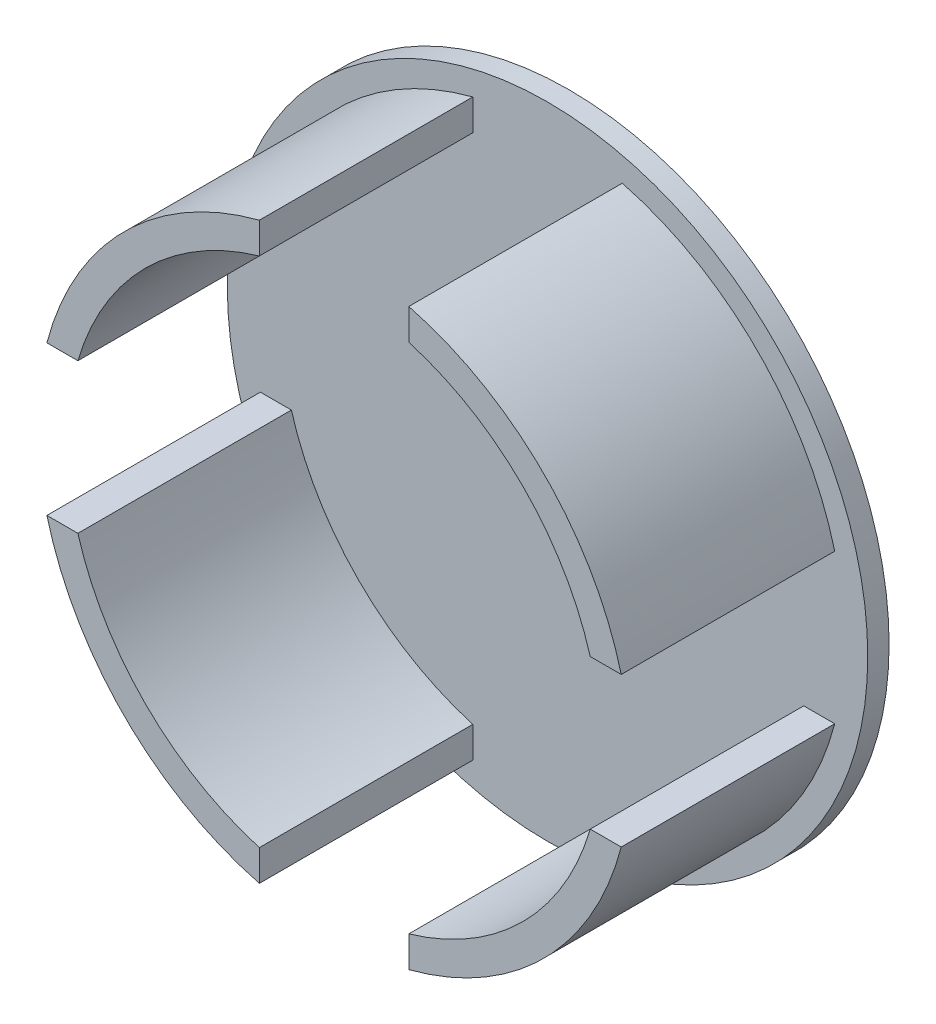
ISO-10303-21;
HEADER;
FILE_DESCRIPTION(('STEP AP214'),'2;1');
FILE_NAME('part.step','',(''),(''),'','','');
FILE_SCHEMA(('AUTOMOTIVE_DESIGN { 1 0 10303 214 1 1 1 1 }'));
ENDSEC;
DATA;
#1=APPLICATION_CONTEXT('core data for automotive mechanical design processes');
#2=APPLICATION_PROTOCOL_DEFINITION('international standard','automotive_design',2000,#1);
#3=PRODUCT_CONTEXT('',#1,'mechanical');
#4=PRODUCT('Part','Part','',(#3));
#5=PRODUCT_RELATED_PRODUCT_CATEGORY('part','',(#4));
#6=PRODUCT_DEFINITION_FORMATION('','',#4);
#7=PRODUCT_DEFINITION_CONTEXT('part definition',#1,'design');
#8=PRODUCT_DEFINITION('design','',#6,#7);
#9=PRODUCT_DEFINITION_SHAPE('','',#8);
#10=(LENGTH_UNIT() NAMED_UNIT(*) SI_UNIT(.MILLI.,.METRE.));
#11=(NAMED_UNIT(*) PLANE_ANGLE_UNIT() SI_UNIT($,.RADIAN.));
#12=(NAMED_UNIT(*) SI_UNIT($,.STERADIAN.) SOLID_ANGLE_UNIT());
#13=UNCERTAINTY_MEASURE_WITH_UNIT(LENGTH_MEASURE(1.E-05),#10,'distance_accuracy_value','');
#14=(GEOMETRIC_REPRESENTATION_CONTEXT(3) GLOBAL_UNCERTAINTY_ASSIGNED_CONTEXT((#13)) GLOBAL_UNIT_ASSIGNED_CONTEXT((#10,
#11,#12)) REPRESENTATION_CONTEXT('',''));
#15=CARTESIAN_POINT('',(0.,0.,0.));
#16=DIRECTION('',(0.,0.,1.));
#17=DIRECTION('',(1.,0.,0.));
#18=AXIS2_PLACEMENT_3D('',#15,#16,#17);
#19=CARTESIAN_POINT('',(0.,0.,11.));
#20=DIRECTION('',(0.,0.,1.));
#21=DIRECTION('',(1.,0.,0.));
#22=AXIS2_PLACEMENT_3D('',#19,#20,#21);
#23=PLANE('',#22);
#24=DIRECTION('',(0.,1.,0.));
#25=VECTOR('',#24,1.);
#26=CARTESIAN_POINT('',(3.5,-3.5,11.));
#27=LINE('',#26,#25);
#28=CARTESIAN_POINT('',(3.5,-13.4521373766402,11.));
#29=VERTEX_POINT('',#28);
#30=CARTESIAN_POINT('',(3.5,-12.,11.));
#31=VERTEX_POINT('',#30);
#32=EDGE_CURVE('E175',#29,#31,#27,.T.);
#33=ORIENTED_EDGE('',*,*,#32,.F.);
#34=CARTESIAN_POINT('',(0.,0.,11.));
#35=DIRECTION('',(0.,0.,1.));
#36=DIRECTION('',(1.,0.,0.));
#37=AXIS2_PLACEMENT_3D('',#34,#35,#36);
#38=CIRCLE('',#37,13.9);
#39=CARTESIAN_POINT('',(13.4521373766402,-3.5,11.));
#40=VERTEX_POINT('',#39);
#41=EDGE_CURVE('E173',#29,#40,#38,.T.);
#42=ORIENTED_EDGE('',*,*,#41,.T.);
#43=DIRECTION('',(1.,0.,0.));
#44=VECTOR('',#43,1.);
#45=CARTESIAN_POINT('',(3.5,-3.5,11.));
#46=LINE('',#45,#44);
#47=CARTESIAN_POINT('',(12.,-3.5,11.));
#48=VERTEX_POINT('',#47);
#49=EDGE_CURVE('E157',#48,#40,#46,.T.);
#50=ORIENTED_EDGE('',*,*,#49,.F.);
#51=CARTESIAN_POINT('',(0.,0.,11.));
#52=DIRECTION('',(0.,0.,1.));
#53=DIRECTION('',(1.,0.,0.));
#54=AXIS2_PLACEMENT_3D('',#51,#52,#53);
#55=CIRCLE('',#54,12.5);
#56=EDGE_CURVE('E171',#31,#48,#55,.T.);
#57=ORIENTED_EDGE('',*,*,#56,.F.);
#58=EDGE_LOOP('',(#33,#42,#50,#57));
#59=FACE_BOUND('',#58,.T.);
#60=ADVANCED_FACE('F39',(#59),#23,.T.);
#61=DIRECTION('',(0.,-1.,0.));
#62=VECTOR('',#61,1.);
#63=CARTESIAN_POINT('',(-3.5,-3.5,11.));
#64=LINE('',#63,#62);
#65=CARTESIAN_POINT('',(-3.5,-12.,11.));
#66=VERTEX_POINT('',#65);
#67=CARTESIAN_POINT('',(-3.5,-13.4521373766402,11.));
#68=VERTEX_POINT('',#67);
#69=EDGE_CURVE('E222',#66,#68,#64,.T.);
#70=ORIENTED_EDGE('',*,*,#69,.F.);
#71=CARTESIAN_POINT('',(-12.,-3.5,11.));
#72=VERTEX_POINT('',#71);
#73=EDGE_CURVE('E181',#72,#66,#55,.T.);
#74=ORIENTED_EDGE('',*,*,#73,.F.);
#75=DIRECTION('',(1.,0.,0.));
#76=VECTOR('',#75,1.);
#77=CARTESIAN_POINT('',(-20.7115293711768,-3.5,11.));
#78=LINE('',#77,#76);
#79=CARTESIAN_POINT('',(-13.4521373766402,-3.5,11.));
#80=VERTEX_POINT('',#79);
#81=EDGE_CURVE('E220',#80,#72,#78,.T.);
#82=ORIENTED_EDGE('',*,*,#81,.F.);
#83=EDGE_CURVE('E296',#80,#68,#38,.T.);
#84=ORIENTED_EDGE('',*,*,#83,.T.);
#85=EDGE_LOOP('',(#70,#74,#82,#84));
#86=FACE_BOUND('',#85,.T.);
#87=ADVANCED_FACE('F321',(#86),#23,.T.);
#88=DIRECTION('',(-1.,0.,0.));
#89=VECTOR('',#88,1.);
#90=CARTESIAN_POINT('',(-20.7115293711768,3.5,11.));
#91=LINE('',#90,#89);
#92=CARTESIAN_POINT('',(-12.,3.5,11.));
#93=VERTEX_POINT('',#92);
#94=CARTESIAN_POINT('',(-13.4521373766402,3.5,11.));
#95=VERTEX_POINT('',#94);
#96=EDGE_CURVE('E216',#93,#95,#91,.T.);
#97=ORIENTED_EDGE('',*,*,#96,.F.);
#98=CARTESIAN_POINT('',(-3.5,12.,11.));
#99=VERTEX_POINT('',#98);
#100=EDGE_CURVE('E186',#99,#93,#55,.T.);
#101=ORIENTED_EDGE('',*,*,#100,.F.);
#102=DIRECTION('',(0.,-1.,0.));
#103=VECTOR('',#102,1.);
#104=CARTESIAN_POINT('',(-3.5,18.3029045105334,11.));
#105=LINE('',#104,#103);
#106=CARTESIAN_POINT('',(-3.5,13.4521373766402,11.));
#107=VERTEX_POINT('',#106);
#108=EDGE_CURVE('E214',#107,#99,#105,.T.);
#109=ORIENTED_EDGE('',*,*,#108,.F.);
#110=EDGE_CURVE('E217',#107,#95,#38,.T.);
#111=ORIENTED_EDGE('',*,*,#110,.T.);
#112=EDGE_LOOP('',(#97,#101,#109,#111));
#113=FACE_BOUND('',#112,.T.);
#114=ADVANCED_FACE('F212',(#113),#23,.T.);
#115=CARTESIAN_POINT('',(0.,0.,11.));
#116=DIRECTION('',(0.,0.,-1.));
#117=DIRECTION('',(-1.,0.,0.));
#118=AXIS2_PLACEMENT_3D('',#115,#116,#117);
#119=CYLINDRICAL_SURFACE('',#118,13.9);
#120=ORIENTED_EDGE('',*,*,#41,.F.);
#121=DIRECTION('',(0.,0.,-1.));
#122=VECTOR('',#121,1.);
#123=CARTESIAN_POINT('',(3.5,-13.4521373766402,11.));
#124=LINE('',#123,#122);
#125=CARTESIAN_POINT('',(3.5,-13.4521373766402,0.999999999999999));
#126=VERTEX_POINT('',#125);
#127=EDGE_CURVE('E182',#29,#126,#124,.T.);
#128=ORIENTED_EDGE('',*,*,#127,.T.);
#129=CARTESIAN_POINT('',(0.,0.,1.));
#130=DIRECTION('',(0.,0.,1.));
#131=DIRECTION('',(1.,0.,0.));
#132=AXIS2_PLACEMENT_3D('',#129,#130,#131);
#133=CIRCLE('',#132,13.9);
#134=CARTESIAN_POINT('',(13.4521373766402,-3.5,0.999999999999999));
#135=VERTEX_POINT('',#134);
#136=EDGE_CURVE('E191',#126,#135,#133,.T.);
#137=ORIENTED_EDGE('',*,*,#136,.T.);
#138=DIRECTION('',(0.,0.,-1.));
#139=VECTOR('',#138,1.);
#140=CARTESIAN_POINT('',(13.4521373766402,-3.5,11.));
#141=LINE('',#140,#139);
#142=EDGE_CURVE('E164',#135,#40,#141,.F.);
#143=ORIENTED_EDGE('',*,*,#142,.T.);
#144=EDGE_LOOP('',(#120,#128,#137,#143));
#145=FACE_BOUND('',#144,.T.);
#146=ADVANCED_FACE('F352',(#145),#119,.T.);
#147=CARTESIAN_POINT('',(-13.4521373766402,-3.5,0.999999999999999));
#148=VERTEX_POINT('',#147);
#149=CARTESIAN_POINT('',(-3.5,-13.4521373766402,0.999999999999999));
#150=VERTEX_POINT('',#149);
#151=EDGE_CURVE('E197',#148,#150,#133,.T.);
#152=ORIENTED_EDGE('',*,*,#151,.T.);
#153=DIRECTION('',(0.,0.,-1.));
#154=VECTOR('',#153,1.);
#155=CARTESIAN_POINT('',(-3.5,-13.4521373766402,11.));
#156=LINE('',#155,#154);
#157=EDGE_CURVE('E256',#150,#68,#156,.F.);
#158=ORIENTED_EDGE('',*,*,#157,.T.);
#159=ORIENTED_EDGE('',*,*,#83,.F.);
#160=DIRECTION('',(0.,0.,-1.));
#161=VECTOR('',#160,1.);
#162=CARTESIAN_POINT('',(-13.4521373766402,-3.5,11.));
#163=LINE('',#162,#161);
#164=EDGE_CURVE('E251',#80,#148,#163,.T.);
#165=ORIENTED_EDGE('',*,*,#164,.T.);
#166=EDGE_LOOP('',(#152,#158,#159,#165));
#167=FACE_BOUND('',#166,.T.);
#168=ADVANCED_FACE('F323',(#167),#119,.T.);
#169=CARTESIAN_POINT('',(-3.5,13.4521373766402,0.999999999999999));
#170=VERTEX_POINT('',#169);
#171=CARTESIAN_POINT('',(-13.4521373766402,3.5,0.999999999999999));
#172=VERTEX_POINT('',#171);
#173=EDGE_CURVE('E298',#170,#172,#133,.T.);
#174=ORIENTED_EDGE('',*,*,#173,.T.);
#175=DIRECTION('',(0.,0.,-1.));
#176=VECTOR('',#175,1.);
#177=CARTESIAN_POINT('',(-13.4521373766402,3.5,11.));
#178=LINE('',#177,#176);
#179=EDGE_CURVE('E246',#172,#95,#178,.F.);
#180=ORIENTED_EDGE('',*,*,#179,.T.);
#181=ORIENTED_EDGE('',*,*,#110,.F.);
#182=DIRECTION('',(0.,0.,-1.));
#183=VECTOR('',#182,1.);
#184=CARTESIAN_POINT('',(-3.5,13.4521373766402,11.));
#185=LINE('',#184,#183);
#186=EDGE_CURVE('E242',#107,#170,#185,.T.);
#187=ORIENTED_EDGE('',*,*,#186,.T.);
#188=EDGE_LOOP('',(#174,#180,#181,#187));
#189=FACE_BOUND('',#188,.T.);
#190=ADVANCED_FACE('F353',(#189),#119,.T.);
#191=CARTESIAN_POINT('',(0.,0.,11.));
#192=DIRECTION('',(0.,0.,-1.));
#193=DIRECTION('',(-1.,0.,0.));
#194=AXIS2_PLACEMENT_3D('',#191,#192,#193);
#195=CYLINDRICAL_SURFACE('',#194,12.5);
#196=DIRECTION('',(0.,0.,-1.));
#197=VECTOR('',#196,1.);
#198=CARTESIAN_POINT('',(3.5,-12.,11.));
#199=LINE('',#198,#197);
#200=CARTESIAN_POINT('',(3.5,-12.,1.));
#201=VERTEX_POINT('',#200);
#202=EDGE_CURVE('E180',#31,#201,#199,.T.);
#203=ORIENTED_EDGE('',*,*,#202,.F.);
#204=ORIENTED_EDGE('',*,*,#56,.T.);
#205=DIRECTION('',(0.,0.,-1.));
#206=VECTOR('',#205,1.);
#207=CARTESIAN_POINT('',(12.,-3.5,11.));
#208=LINE('',#207,#206);
#209=CARTESIAN_POINT('',(12.,-3.5,0.999999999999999));
#210=VERTEX_POINT('',#209);
#211=EDGE_CURVE('E154',#210,#48,#208,.F.);
#212=ORIENTED_EDGE('',*,*,#211,.F.);
#213=CARTESIAN_POINT('',(0.,0.,1.));
#214=DIRECTION('',(0.,0.,1.));
#215=DIRECTION('',(1.,0.,0.));
#216=AXIS2_PLACEMENT_3D('',#213,#214,#215);
#217=CIRCLE('',#216,12.5);
#218=EDGE_CURVE('E11',#210,#201,#217,.F.);
#219=ORIENTED_EDGE('',*,*,#218,.T.);
#220=EDGE_LOOP('',(#203,#204,#212,#219));
#221=FACE_BOUND('',#220,.T.);
#222=ADVANCED_FACE('F178',(#221),#195,.F.);
#223=DIRECTION('',(0.,0.,-1.));
#224=VECTOR('',#223,1.);
#225=CARTESIAN_POINT('',(-3.5,-12.,11.));
#226=LINE('',#225,#224);
#227=CARTESIAN_POINT('',(-3.5,-12.,0.999999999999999));
#228=VERTEX_POINT('',#227);
#229=EDGE_CURVE('E254',#228,#66,#226,.F.);
#230=ORIENTED_EDGE('',*,*,#229,.F.);
#231=CARTESIAN_POINT('',(-12.,-3.5,1.));
#232=VERTEX_POINT('',#231);
#233=EDGE_CURVE('E47',#228,#232,#217,.F.);
#234=ORIENTED_EDGE('',*,*,#233,.T.);
#235=DIRECTION('',(0.,0.,-1.));
#236=VECTOR('',#235,1.);
#237=CARTESIAN_POINT('',(-12.,-3.5,11.));
#238=LINE('',#237,#236);
#239=EDGE_CURVE('E248',#72,#232,#238,.T.);
#240=ORIENTED_EDGE('',*,*,#239,.F.);
#241=ORIENTED_EDGE('',*,*,#73,.T.);
#242=EDGE_LOOP('',(#230,#234,#240,#241));
#243=FACE_BOUND('',#242,.T.);
#244=ADVANCED_FACE('F310',(#243),#195,.F.);
#245=DIRECTION('',(0.,0.,-1.));
#246=VECTOR('',#245,1.);
#247=CARTESIAN_POINT('',(-12.,3.5,11.));
#248=LINE('',#247,#246);
#249=CARTESIAN_POINT('',(-12.,3.5,0.999999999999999));
#250=VERTEX_POINT('',#249);
#251=EDGE_CURVE('E207',#250,#93,#248,.F.);
#252=ORIENTED_EDGE('',*,*,#251,.F.);
#253=CARTESIAN_POINT('',(-3.5,12.,1.));
#254=VERTEX_POINT('',#253);
#255=EDGE_CURVE('E304',#250,#254,#217,.F.);
#256=ORIENTED_EDGE('',*,*,#255,.T.);
#257=DIRECTION('',(0.,0.,-1.));
#258=VECTOR('',#257,1.);
#259=CARTESIAN_POINT('',(-3.5,12.,11.));
#260=LINE('',#259,#258);
#261=EDGE_CURVE('E208',#99,#254,#260,.T.);
#262=ORIENTED_EDGE('',*,*,#261,.F.);
#263=ORIENTED_EDGE('',*,*,#100,.T.);
#264=EDGE_LOOP('',(#252,#256,#262,#263));
#265=FACE_BOUND('',#264,.T.);
#266=ADVANCED_FACE('F205',(#265),#195,.F.);
#267=CARTESIAN_POINT('',(0.,0.,1.));
#268=DIRECTION('',(0.,0.,-1.));
#269=DIRECTION('',(-1.,0.,0.));
#270=AXIS2_PLACEMENT_3D('',#267,#268,#269);
#271=CYLINDRICAL_SURFACE('',#270,15.);
#272=CARTESIAN_POINT('',(0.,0.,1.));
#273=DIRECTION('',(0.,0.,1.));
#274=DIRECTION('',(1.,0.,0.));
#275=AXIS2_PLACEMENT_3D('',#272,#273,#274);
#276=CIRCLE('',#275,15.);
#277=CARTESIAN_POINT('',(15.,0.,1.));
#278=VERTEX_POINT('',#277);
#279=EDGE_CURVE('E295',#278,#278,#276,.T.);
#280=ORIENTED_EDGE('',*,*,#279,.F.);
#281=EDGE_LOOP('',(#280));
#282=FACE_BOUND('',#281,.T.);
#283=CARTESIAN_POINT('',(0.,0.,0.));
#284=DIRECTION('',(0.,0.,1.));
#285=DIRECTION('',(1.,0.,0.));
#286=AXIS2_PLACEMENT_3D('',#283,#284,#285);
#287=CIRCLE('',#286,15.);
#288=CARTESIAN_POINT('',(15.,0.,0.));
#289=VERTEX_POINT('',#288);
#290=EDGE_CURVE('E293',#289,#289,#287,.T.);
#291=ORIENTED_EDGE('',*,*,#290,.T.);
#292=EDGE_LOOP('',(#291));
#293=FACE_BOUND('',#292,.T.);
#294=ADVANCED_FACE('F41',(#282,#293),#271,.T.);
#295=CARTESIAN_POINT('',(0.,0.,1.));
#296=DIRECTION('',(0.,0.,1.));
#297=DIRECTION('',(1.,0.,0.));
#298=AXIS2_PLACEMENT_3D('',#295,#296,#297);
#299=PLANE('',#298);
#300=ORIENTED_EDGE('',*,*,#136,.F.);
#301=DIRECTION('',(0.,1.,0.));
#302=VECTOR('',#301,1.);
#303=CARTESIAN_POINT('',(3.5,-3.5,0.999999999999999));
#304=LINE('',#303,#302);
#305=EDGE_CURVE('E228',#126,#201,#304,.T.);
#306=ORIENTED_EDGE('',*,*,#305,.T.);
#307=ORIENTED_EDGE('',*,*,#218,.F.);
#308=DIRECTION('',(1.,0.,0.));
#309=VECTOR('',#308,1.);
#310=CARTESIAN_POINT('',(3.5,-3.5,0.999999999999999));
#311=LINE('',#310,#309);
#312=EDGE_CURVE('E160',#210,#135,#311,.T.);
#313=ORIENTED_EDGE('',*,*,#312,.T.);
#314=EDGE_LOOP('',(#300,#306,#307,#313));
#315=FACE_BOUND('',#314,.T.);
#316=ORIENTED_EDGE('',*,*,#279,.T.);
#317=EDGE_LOOP('',(#316));
#318=FACE_BOUND('',#317,.T.);
#319=DIRECTION('',(0.,-1.,0.));
#320=VECTOR('',#319,1.);
#321=CARTESIAN_POINT('',(-3.5,-3.5,0.999999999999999));
#322=LINE('',#321,#320);
#323=EDGE_CURVE('E165',#228,#150,#322,.T.);
#324=ORIENTED_EDGE('',*,*,#323,.T.);
#325=ORIENTED_EDGE('',*,*,#151,.F.);
#326=DIRECTION('',(1.,0.,0.));
#327=VECTOR('',#326,1.);
#328=CARTESIAN_POINT('',(-20.7115293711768,-3.5,0.999999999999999));
#329=LINE('',#328,#327);
#330=EDGE_CURVE('E276',#148,#232,#329,.T.);
#331=ORIENTED_EDGE('',*,*,#330,.T.);
#332=ORIENTED_EDGE('',*,*,#233,.F.);
#333=EDGE_LOOP('',(#324,#325,#331,#332));
#334=FACE_BOUND('',#333,.T.);
#335=DIRECTION('',(-1.,0.,0.));
#336=VECTOR('',#335,1.);
#337=CARTESIAN_POINT('',(-20.7115293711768,3.5,0.999999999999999));
#338=LINE('',#337,#336);
#339=EDGE_CURVE('E273',#250,#172,#338,.T.);
#340=ORIENTED_EDGE('',*,*,#339,.T.);
#341=ORIENTED_EDGE('',*,*,#173,.F.);
#342=DIRECTION('',(0.,-1.,0.));
#343=VECTOR('',#342,1.);
#344=CARTESIAN_POINT('',(-3.5,18.3029045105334,0.999999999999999));
#345=LINE('',#344,#343);
#346=EDGE_CURVE('E63',#170,#254,#345,.T.);
#347=ORIENTED_EDGE('',*,*,#346,.T.);
#348=ORIENTED_EDGE('',*,*,#255,.F.);
#349=EDGE_LOOP('',(#340,#341,#347,#348));
#350=FACE_BOUND('',#349,.T.);
#351=DIRECTION('',(0.,1.,0.));
#352=VECTOR('',#351,1.);
#353=CARTESIAN_POINT('',(3.5,18.3029045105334,0.999999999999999));
#354=LINE('',#353,#352);
#355=CARTESIAN_POINT('',(3.5,12.,0.999999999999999));
#356=VERTEX_POINT('',#355);
#357=CARTESIAN_POINT('',(3.5,13.4521373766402,0.999999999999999));
#358=VERTEX_POINT('',#357);
#359=EDGE_CURVE('E269',#356,#358,#354,.T.);
#360=ORIENTED_EDGE('',*,*,#359,.T.);
#361=CARTESIAN_POINT('',(13.4521373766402,3.5,0.999999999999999));
#362=VERTEX_POINT('',#361);
#363=EDGE_CURVE('E199',#362,#358,#133,.T.);
#364=ORIENTED_EDGE('',*,*,#363,.F.);
#365=DIRECTION('',(-1.,0.,0.));
#366=VECTOR('',#365,1.);
#367=CARTESIAN_POINT('',(3.5,3.5,0.999999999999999));
#368=LINE('',#367,#366);
#369=CARTESIAN_POINT('',(12.,3.5,1.));
#370=VERTEX_POINT('',#369);
#371=EDGE_CURVE('E55',#362,#370,#368,.T.);
#372=ORIENTED_EDGE('',*,*,#371,.T.);
#373=EDGE_CURVE('E48',#356,#370,#217,.F.);
#374=ORIENTED_EDGE('',*,*,#373,.F.);
#375=EDGE_LOOP('',(#360,#364,#372,#374));
#376=FACE_BOUND('',#375,.T.);
#377=ADVANCED_FACE('F263',(#315,#318,#334,#350,#376),#299,.T.);
#378=CARTESIAN_POINT('',(0.,0.,0.));
#379=DIRECTION('',(0.,0.,1.));
#380=DIRECTION('',(1.,0.,0.));
#381=AXIS2_PLACEMENT_3D('',#378,#379,#380);
#382=PLANE('',#381);
#383=ORIENTED_EDGE('',*,*,#290,.F.);
#384=EDGE_LOOP('',(#383));
#385=FACE_BOUND('',#384,.T.);
#386=ADVANCED_FACE('F346',(#385),#382,.F.);
#387=DIRECTION('',(0.,1.,0.));
#388=VECTOR('',#387,1.);
#389=CARTESIAN_POINT('',(3.5,18.3029045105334,11.));
#390=LINE('',#389,#388);
#391=CARTESIAN_POINT('',(3.5,12.,11.));
#392=VERTEX_POINT('',#391);
#393=CARTESIAN_POINT('',(3.5,13.4521373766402,11.));
#394=VERTEX_POINT('',#393);
#395=EDGE_CURVE('E224',#392,#394,#390,.T.);
#396=ORIENTED_EDGE('',*,*,#395,.F.);
#397=CARTESIAN_POINT('',(12.,3.5,11.));
#398=VERTEX_POINT('',#397);
#399=EDGE_CURVE('E184',#398,#392,#55,.T.);
#400=ORIENTED_EDGE('',*,*,#399,.F.);
#401=DIRECTION('',(-1.,0.,0.));
#402=VECTOR('',#401,1.);
#403=CARTESIAN_POINT('',(3.5,3.5,11.));
#404=LINE('',#403,#402);
#405=CARTESIAN_POINT('',(13.4521373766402,3.5,11.));
#406=VERTEX_POINT('',#405);
#407=EDGE_CURVE('E174',#406,#398,#404,.T.);
#408=ORIENTED_EDGE('',*,*,#407,.F.);
#409=EDGE_CURVE('E290',#406,#394,#38,.T.);
#410=ORIENTED_EDGE('',*,*,#409,.T.);
#411=EDGE_LOOP('',(#396,#400,#408,#410));
#412=FACE_BOUND('',#411,.T.);
#413=ADVANCED_FACE('F292',(#412),#23,.T.);
#414=ORIENTED_EDGE('',*,*,#363,.T.);
#415=DIRECTION('',(0.,0.,-1.));
#416=VECTOR('',#415,1.);
#417=CARTESIAN_POINT('',(3.5,13.4521373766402,11.));
#418=LINE('',#417,#416);
#419=EDGE_CURVE('E238',#358,#394,#418,.F.);
#420=ORIENTED_EDGE('',*,*,#419,.T.);
#421=ORIENTED_EDGE('',*,*,#409,.F.);
#422=DIRECTION('',(0.,0.,-1.));
#423=VECTOR('',#422,1.);
#424=CARTESIAN_POINT('',(13.4521373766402,3.5,11.));
#425=LINE('',#424,#423);
#426=EDGE_CURVE('E233',#406,#362,#425,.T.);
#427=ORIENTED_EDGE('',*,*,#426,.T.);
#428=EDGE_LOOP('',(#414,#420,#421,#427));
#429=FACE_BOUND('',#428,.T.);
#430=ADVANCED_FACE('F289',(#429),#119,.T.);
#431=DIRECTION('',(0.,0.,-1.));
#432=VECTOR('',#431,1.);
#433=CARTESIAN_POINT('',(3.5,12.,11.));
#434=LINE('',#433,#432);
#435=EDGE_CURVE('E236',#356,#392,#434,.F.);
#436=ORIENTED_EDGE('',*,*,#435,.F.);
#437=ORIENTED_EDGE('',*,*,#373,.T.);
#438=DIRECTION('',(0.,0.,-1.));
#439=VECTOR('',#438,1.);
#440=CARTESIAN_POINT('',(12.,3.5,11.));
#441=LINE('',#440,#439);
#442=EDGE_CURVE('E231',#398,#370,#441,.T.);
#443=ORIENTED_EDGE('',*,*,#442,.F.);
#444=ORIENTED_EDGE('',*,*,#399,.T.);
#445=EDGE_LOOP('',(#436,#437,#443,#444));
#446=FACE_BOUND('',#445,.T.);
#447=ADVANCED_FACE('F351',(#446),#195,.F.);
#448=CARTESIAN_POINT('',(3.5,-3.5,0.999999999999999));
#449=DIRECTION('',(0.,-1.,0.));
#450=DIRECTION('',(0.,0.,-1.));
#451=AXIS2_PLACEMENT_3D('',#448,#449,#450);
#452=PLANE('',#451);
#453=ORIENTED_EDGE('',*,*,#312,.F.);
#454=ORIENTED_EDGE('',*,*,#211,.T.);
#455=ORIENTED_EDGE('',*,*,#49,.T.);
#456=ORIENTED_EDGE('',*,*,#142,.F.);
#457=EDGE_LOOP('',(#453,#454,#455,#456));
#458=FACE_BOUND('',#457,.T.);
#459=ADVANCED_FACE('F156',(#458),#452,.F.);
#460=CARTESIAN_POINT('',(3.5,3.5,0.999999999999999));
#461=DIRECTION('',(0.,1.,0.));
#462=DIRECTION('',(-1.,0.,0.));
#463=AXIS2_PLACEMENT_3D('',#460,#461,#462);
#464=PLANE('',#463);
#465=ORIENTED_EDGE('',*,*,#407,.T.);
#466=ORIENTED_EDGE('',*,*,#442,.T.);
#467=ORIENTED_EDGE('',*,*,#371,.F.);
#468=ORIENTED_EDGE('',*,*,#426,.F.);
#469=EDGE_LOOP('',(#465,#466,#467,#468));
#470=FACE_BOUND('',#469,.T.);
#471=ADVANCED_FACE('F327',(#470),#464,.F.);
#472=CARTESIAN_POINT('',(-3.5,-3.5,0.999999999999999));
#473=DIRECTION('',(-1.,0.,0.));
#474=DIRECTION('',(0.,-1.,0.));
#475=AXIS2_PLACEMENT_3D('',#472,#473,#474);
#476=PLANE('',#475);
#477=ORIENTED_EDGE('',*,*,#323,.F.);
#478=ORIENTED_EDGE('',*,*,#229,.T.);
#479=ORIENTED_EDGE('',*,*,#69,.T.);
#480=ORIENTED_EDGE('',*,*,#157,.F.);
#481=EDGE_LOOP('',(#477,#478,#479,#480));
#482=FACE_BOUND('',#481,.T.);
#483=ADVANCED_FACE('F325',(#482),#476,.F.);
#484=CARTESIAN_POINT('',(3.5,-3.5,0.999999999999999));
#485=DIRECTION('',(1.,0.,0.));
#486=DIRECTION('',(0.,1.,0.));
#487=AXIS2_PLACEMENT_3D('',#484,#485,#486);
#488=PLANE('',#487);
#489=ORIENTED_EDGE('',*,*,#32,.T.);
#490=ORIENTED_EDGE('',*,*,#202,.T.);
#491=ORIENTED_EDGE('',*,*,#305,.F.);
#492=ORIENTED_EDGE('',*,*,#127,.F.);
#493=EDGE_LOOP('',(#489,#490,#491,#492));
#494=FACE_BOUND('',#493,.T.);
#495=ADVANCED_FACE('F260',(#494),#488,.F.);
#496=CARTESIAN_POINT('',(-20.7115293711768,3.5,0.999999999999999));
#497=DIRECTION('',(0.,1.,0.));
#498=DIRECTION('',(-1.,0.,0.));
#499=AXIS2_PLACEMENT_3D('',#496,#497,#498);
#500=PLANE('',#499);
#501=ORIENTED_EDGE('',*,*,#339,.F.);
#502=ORIENTED_EDGE('',*,*,#251,.T.);
#503=ORIENTED_EDGE('',*,*,#96,.T.);
#504=ORIENTED_EDGE('',*,*,#179,.F.);
#505=EDGE_LOOP('',(#501,#502,#503,#504));
#506=FACE_BOUND('',#505,.T.);
#507=ADVANCED_FACE('F333',(#506),#500,.F.);
#508=CARTESIAN_POINT('',(-20.7115293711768,-3.5,0.999999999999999));
#509=DIRECTION('',(0.,-1.,0.));
#510=DIRECTION('',(0.,0.,-1.));
#511=AXIS2_PLACEMENT_3D('',#508,#509,#510);
#512=PLANE('',#511);
#513=ORIENTED_EDGE('',*,*,#81,.T.);
#514=ORIENTED_EDGE('',*,*,#239,.T.);
#515=ORIENTED_EDGE('',*,*,#330,.F.);
#516=ORIENTED_EDGE('',*,*,#164,.F.);
#517=EDGE_LOOP('',(#513,#514,#515,#516));
#518=FACE_BOUND('',#517,.T.);
#519=ADVANCED_FACE('F316',(#518),#512,.F.);
#520=CARTESIAN_POINT('',(-3.5,18.3029045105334,0.999999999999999));
#521=DIRECTION('',(-1.,0.,0.));
#522=DIRECTION('',(0.,0.,1.));
#523=AXIS2_PLACEMENT_3D('',#520,#521,#522);
#524=PLANE('',#523);
#525=ORIENTED_EDGE('',*,*,#108,.T.);
#526=ORIENTED_EDGE('',*,*,#261,.T.);
#527=ORIENTED_EDGE('',*,*,#346,.F.);
#528=ORIENTED_EDGE('',*,*,#186,.F.);
#529=EDGE_LOOP('',(#525,#526,#527,#528));
#530=FACE_BOUND('',#529,.T.);
#531=ADVANCED_FACE('F394',(#530),#524,.F.);
#532=CARTESIAN_POINT('',(3.5,18.3029045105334,0.999999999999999));
#533=DIRECTION('',(1.,0.,0.));
#534=DIRECTION('',(0.,1.,0.));
#535=AXIS2_PLACEMENT_3D('',#532,#533,#534);
#536=PLANE('',#535);
#537=ORIENTED_EDGE('',*,*,#359,.F.);
#538=ORIENTED_EDGE('',*,*,#435,.T.);
#539=ORIENTED_EDGE('',*,*,#395,.T.);
#540=ORIENTED_EDGE('',*,*,#419,.F.);
#541=EDGE_LOOP('',(#537,#538,#539,#540));
#542=FACE_BOUND('',#541,.T.);
#543=ADVANCED_FACE('F283',(#542),#536,.F.);
#544=CLOSED_SHELL('',(#60,#87,#114,#146,#168,#190,#222,#244,#266,#294,#377,#386,#413,#430,#447,
#459,#471,#483,#495,#507,#519,#531,#543));
#545=MANIFOLD_SOLID_BREP('B2',#544);
#546=ADVANCED_BREP_SHAPE_REPRESENTATION('',(#18,#545),#14);
#547=SHAPE_DEFINITION_REPRESENTATION(#9,#546);
ENDSEC;
END-ISO-10303-21;
